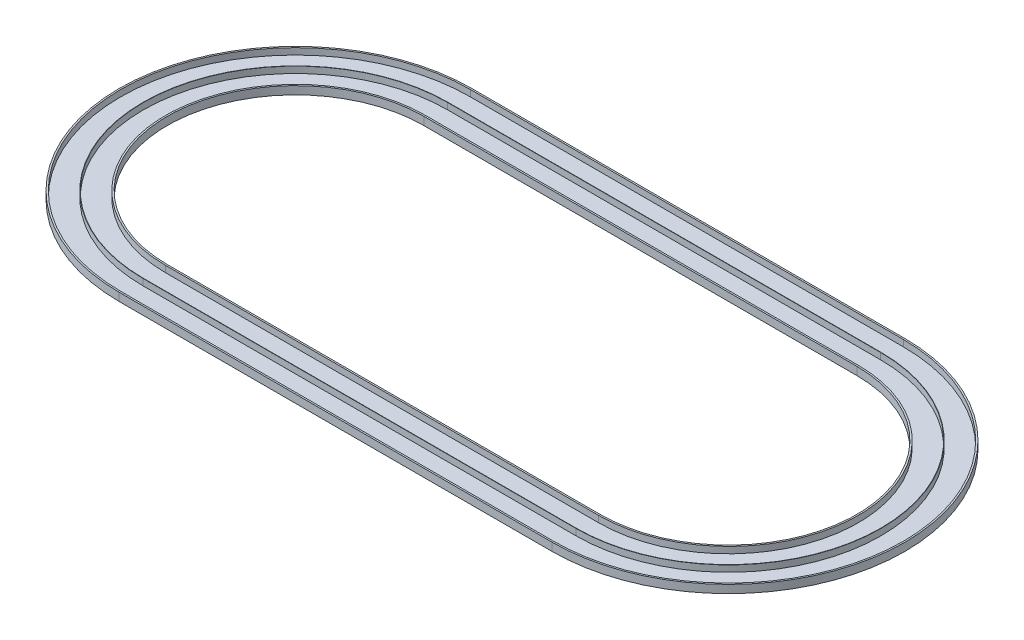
ISO-10303-21;
HEADER;
FILE_DESCRIPTION(('STEP AP214'),'2;1');
FILE_NAME('part.step','',(''),(''),'','','');
FILE_SCHEMA(('AUTOMOTIVE_DESIGN { 1 0 10303 214 1 1 1 1 }'));
ENDSEC;
DATA;
#1=APPLICATION_CONTEXT('core data for automotive mechanical design processes');
#2=APPLICATION_PROTOCOL_DEFINITION('international standard','automotive_design',2000,#1);
#3=PRODUCT_CONTEXT('',#1,'mechanical');
#4=PRODUCT('Part','Part','',(#3));
#5=PRODUCT_RELATED_PRODUCT_CATEGORY('part','',(#4));
#6=PRODUCT_DEFINITION_FORMATION('','',#4);
#7=PRODUCT_DEFINITION_CONTEXT('part definition',#1,'design');
#8=PRODUCT_DEFINITION('design','',#6,#7);
#9=PRODUCT_DEFINITION_SHAPE('','',#8);
#10=(LENGTH_UNIT() NAMED_UNIT(*) SI_UNIT(.MILLI.,.METRE.));
#11=(NAMED_UNIT(*) PLANE_ANGLE_UNIT() SI_UNIT($,.RADIAN.));
#12=(NAMED_UNIT(*) SI_UNIT($,.STERADIAN.) SOLID_ANGLE_UNIT());
#13=UNCERTAINTY_MEASURE_WITH_UNIT(LENGTH_MEASURE(1.E-05),#10,'distance_accuracy_value','');
#14=(GEOMETRIC_REPRESENTATION_CONTEXT(3) GLOBAL_UNCERTAINTY_ASSIGNED_CONTEXT((#13)) GLOBAL_UNIT_ASSIGNED_CONTEXT((#10,
#11,#12)) REPRESENTATION_CONTEXT('',''));
#15=CARTESIAN_POINT('',(0.,0.,0.));
#16=DIRECTION('',(0.,0.,1.));
#17=DIRECTION('',(1.,0.,0.));
#18=AXIS2_PLACEMENT_3D('',#15,#16,#17);
#19=CARTESIAN_POINT('',(0.,2.54,0.));
#20=DIRECTION('',(0.,1.,0.));
#21=DIRECTION('',(0.,0.,1.));
#22=AXIS2_PLACEMENT_3D('',#19,#20,#21);
#23=PLANE('',#22);
#24=CARTESIAN_POINT('',(0.,2.54,0.));
#25=DIRECTION('',(0.,1.,0.));
#26=DIRECTION('',(0.,0.,1.));
#27=AXIS2_PLACEMENT_3D('',#24,#25,#26);
#28=CIRCLE('',#27,276.86);
#29=CARTESIAN_POINT('',(0.,2.54,-276.86));
#30=VERTEX_POINT('',#29);
#31=CARTESIAN_POINT('',(0.,2.54,276.86));
#32=VERTEX_POINT('',#31);
#33=EDGE_CURVE('E262',#30,#32,#28,.T.);
#34=ORIENTED_EDGE('',*,*,#33,.T.);
#35=DIRECTION('',(1.,0.,0.));
#36=VECTOR('',#35,1.);
#37=CARTESIAN_POINT('',(0.,2.54,276.86));
#38=LINE('',#37,#36);
#39=CARTESIAN_POINT('',(685.8,2.54,276.86));
#40=VERTEX_POINT('',#39);
#41=EDGE_CURVE('E265',#32,#40,#38,.T.);
#42=ORIENTED_EDGE('',*,*,#41,.T.);
#43=CARTESIAN_POINT('',(685.8,2.54,0.));
#44=DIRECTION('',(0.,1.,0.));
#45=DIRECTION('',(0.,0.,1.));
#46=AXIS2_PLACEMENT_3D('',#43,#44,#45);
#47=CIRCLE('',#46,276.86);
#48=CARTESIAN_POINT('',(685.8,2.54,-276.86));
#49=VERTEX_POINT('',#48);
#50=EDGE_CURVE('E270',#40,#49,#47,.T.);
#51=ORIENTED_EDGE('',*,*,#50,.T.);
#52=DIRECTION('',(-1.,0.,0.));
#53=VECTOR('',#52,1.);
#54=CARTESIAN_POINT('',(0.,2.54,-276.86));
#55=LINE('',#54,#53);
#56=EDGE_CURVE('E267',#49,#30,#55,.T.);
#57=ORIENTED_EDGE('',*,*,#56,.T.);
#58=EDGE_LOOP('',(#34,#42,#51,#57));
#59=FACE_BOUND('',#58,.T.);
#60=DIRECTION('',(-1.,0.,0.));
#61=VECTOR('',#60,1.);
#62=CARTESIAN_POINT('',(685.8,2.54,-241.554));
#63=LINE('',#62,#61);
#64=CARTESIAN_POINT('',(685.8,2.54,-241.554));
#65=VERTEX_POINT('',#64);
#66=CARTESIAN_POINT('',(0.,2.54,-241.554));
#67=VERTEX_POINT('',#66);
#68=EDGE_CURVE('E248',#65,#67,#63,.T.);
#69=ORIENTED_EDGE('',*,*,#68,.F.);
#70=CARTESIAN_POINT('',(685.8,2.54,0.));
#71=DIRECTION('',(0.,1.,0.));
#72=DIRECTION('',(0.,0.,1.));
#73=AXIS2_PLACEMENT_3D('',#70,#71,#72);
#74=CIRCLE('',#73,241.554);
#75=CARTESIAN_POINT('',(685.8,2.54,241.554));
#76=VERTEX_POINT('',#75);
#77=EDGE_CURVE('E213',#76,#65,#74,.T.);
#78=ORIENTED_EDGE('',*,*,#77,.F.);
#79=DIRECTION('',(1.,0.,0.));
#80=VECTOR('',#79,1.);
#81=CARTESIAN_POINT('',(685.8,2.54,241.554));
#82=LINE('',#81,#80);
#83=CARTESIAN_POINT('',(0.,2.54,241.554));
#84=VERTEX_POINT('',#83);
#85=EDGE_CURVE('E239',#84,#76,#82,.T.);
#86=ORIENTED_EDGE('',*,*,#85,.F.);
#87=CARTESIAN_POINT('',(0.,2.54,0.));
#88=DIRECTION('',(0.,1.,0.));
#89=DIRECTION('',(0.,0.,1.));
#90=AXIS2_PLACEMENT_3D('',#87,#88,#89);
#91=CIRCLE('',#90,241.554);
#92=EDGE_CURVE('E250',#67,#84,#91,.T.);
#93=ORIENTED_EDGE('',*,*,#92,.F.);
#94=EDGE_LOOP('',(#69,#78,#86,#93));
#95=FACE_BOUND('',#94,.T.);
#96=ADVANCED_FACE('F33',(#59,#95),#23,.T.);
#97=CARTESIAN_POINT('',(0.,12.7,0.));
#98=DIRECTION('',(0.,1.,0.));
#99=DIRECTION('',(0.,0.,1.));
#100=AXIS2_PLACEMENT_3D('',#97,#98,#99);
#101=PLANE('',#100);
#102=DIRECTION('',(1.,0.,0.));
#103=VECTOR('',#102,1.);
#104=CARTESIAN_POINT('',(0.,12.7,203.2));
#105=LINE('',#104,#103);
#106=CARTESIAN_POINT('',(0.,12.7,203.2));
#107=VERTEX_POINT('',#106);
#108=CARTESIAN_POINT('',(685.8,12.7,203.2));
#109=VERTEX_POINT('',#108);
#110=EDGE_CURVE('E328',#107,#109,#105,.T.);
#111=ORIENTED_EDGE('',*,*,#110,.F.);
#112=CARTESIAN_POINT('',(0.,12.7,0.));
#113=DIRECTION('',(0.,1.,0.));
#114=DIRECTION('',(0.,0.,1.));
#115=AXIS2_PLACEMENT_3D('',#112,#113,#114);
#116=CIRCLE('',#115,203.2);
#117=CARTESIAN_POINT('',(0.,12.7,-203.2));
#118=VERTEX_POINT('',#117);
#119=EDGE_CURVE('E326',#118,#107,#116,.T.);
#120=ORIENTED_EDGE('',*,*,#119,.F.);
#121=DIRECTION('',(-1.,0.,0.));
#122=VECTOR('',#121,1.);
#123=CARTESIAN_POINT('',(0.,12.7,-203.2));
#124=LINE('',#123,#122);
#125=CARTESIAN_POINT('',(685.8,12.7,-203.2));
#126=VERTEX_POINT('',#125);
#127=EDGE_CURVE('E334',#126,#118,#124,.T.);
#128=ORIENTED_EDGE('',*,*,#127,.F.);
#129=CARTESIAN_POINT('',(685.8,12.7,0.));
#130=DIRECTION('',(0.,1.,0.));
#131=DIRECTION('',(0.,0.,1.));
#132=AXIS2_PLACEMENT_3D('',#129,#130,#131);
#133=CIRCLE('',#132,203.2);
#134=EDGE_CURVE('E331',#109,#126,#133,.T.);
#135=ORIENTED_EDGE('',*,*,#134,.F.);
#136=EDGE_LOOP('',(#111,#120,#128,#135));
#137=FACE_BOUND('',#136,.T.);
#138=CARTESIAN_POINT('',(0.,12.7,0.));
#139=DIRECTION('',(0.,1.,0.));
#140=DIRECTION('',(0.,0.,1.));
#141=AXIS2_PLACEMENT_3D('',#138,#139,#140);
#142=CIRCLE('',#141,205.74);
#143=CARTESIAN_POINT('',(0.,12.7,-205.74));
#144=VERTEX_POINT('',#143);
#145=CARTESIAN_POINT('',(0.,12.7,205.74));
#146=VERTEX_POINT('',#145);
#147=EDGE_CURVE('E284',#144,#146,#142,.T.);
#148=ORIENTED_EDGE('',*,*,#147,.T.);
#149=DIRECTION('',(1.,0.,0.));
#150=VECTOR('',#149,1.);
#151=CARTESIAN_POINT('',(0.,12.7,205.74));
#152=LINE('',#151,#150);
#153=CARTESIAN_POINT('',(685.8,12.7,205.74));
#154=VERTEX_POINT('',#153);
#155=EDGE_CURVE('E318',#146,#154,#152,.T.);
#156=ORIENTED_EDGE('',*,*,#155,.T.);
#157=CARTESIAN_POINT('',(685.8,12.7,0.));
#158=DIRECTION('',(0.,1.,0.));
#159=DIRECTION('',(0.,0.,1.));
#160=AXIS2_PLACEMENT_3D('',#157,#158,#159);
#161=CIRCLE('',#160,205.74);
#162=CARTESIAN_POINT('',(685.8,12.7,-205.74));
#163=VERTEX_POINT('',#162);
#164=EDGE_CURVE('E321',#154,#163,#161,.T.);
#165=ORIENTED_EDGE('',*,*,#164,.T.);
#166=DIRECTION('',(-1.,0.,0.));
#167=VECTOR('',#166,1.);
#168=CARTESIAN_POINT('',(0.,12.7,-205.74));
#169=LINE('',#168,#167);
#170=EDGE_CURVE('E303',#163,#144,#169,.T.);
#171=ORIENTED_EDGE('',*,*,#170,.T.);
#172=EDGE_LOOP('',(#148,#156,#165,#171));
#173=FACE_BOUND('',#172,.T.);
#174=ADVANCED_FACE('F409',(#137,#173),#101,.T.);
#175=CARTESIAN_POINT('',(0.,12.7,0.));
#176=DIRECTION('',(0.,1.,0.));
#177=DIRECTION('',(0.,0.,1.));
#178=AXIS2_PLACEMENT_3D('',#175,#176,#177);
#179=CIRCLE('',#178,276.86);
#180=CARTESIAN_POINT('',(0.,12.7,-276.86));
#181=VERTEX_POINT('',#180);
#182=CARTESIAN_POINT('',(0.,12.7,276.86));
#183=VERTEX_POINT('',#182);
#184=EDGE_CURVE('E269',#181,#183,#179,.T.);
#185=ORIENTED_EDGE('',*,*,#184,.F.);
#186=DIRECTION('',(-1.,0.,0.));
#187=VECTOR('',#186,1.);
#188=CARTESIAN_POINT('',(0.,12.7,-276.86));
#189=LINE('',#188,#187);
#190=CARTESIAN_POINT('',(685.8,12.7,-276.86));
#191=VERTEX_POINT('',#190);
#192=EDGE_CURVE('E294',#191,#181,#189,.T.);
#193=ORIENTED_EDGE('',*,*,#192,.F.);
#194=CARTESIAN_POINT('',(685.8,12.7,0.));
#195=DIRECTION('',(0.,1.,0.));
#196=DIRECTION('',(0.,0.,1.));
#197=AXIS2_PLACEMENT_3D('',#194,#195,#196);
#198=CIRCLE('',#197,276.86);
#199=CARTESIAN_POINT('',(685.8,12.7,276.86));
#200=VERTEX_POINT('',#199);
#201=EDGE_CURVE('E312',#200,#191,#198,.T.);
#202=ORIENTED_EDGE('',*,*,#201,.F.);
#203=DIRECTION('',(1.,0.,0.));
#204=VECTOR('',#203,1.);
#205=CARTESIAN_POINT('',(0.,12.7,276.86));
#206=LINE('',#205,#204);
#207=EDGE_CURVE('E310',#183,#200,#206,.T.);
#208=ORIENTED_EDGE('',*,*,#207,.F.);
#209=EDGE_LOOP('',(#185,#193,#202,#208));
#210=FACE_BOUND('',#209,.T.);
#211=CARTESIAN_POINT('',(0.,12.7,0.));
#212=DIRECTION('',(0.,1.,0.));
#213=DIRECTION('',(0.,0.,1.));
#214=AXIS2_PLACEMENT_3D('',#211,#212,#213);
#215=CIRCLE('',#214,279.4);
#216=CARTESIAN_POINT('',(0.,12.7,-279.4));
#217=VERTEX_POINT('',#216);
#218=CARTESIAN_POINT('',(0.,12.7,279.4));
#219=VERTEX_POINT('',#218);
#220=EDGE_CURVE('E357',#217,#219,#215,.T.);
#221=ORIENTED_EDGE('',*,*,#220,.T.);
#222=DIRECTION('',(1.,0.,0.));
#223=VECTOR('',#222,1.);
#224=CARTESIAN_POINT('',(0.,12.7,279.4));
#225=LINE('',#224,#223);
#226=CARTESIAN_POINT('',(685.8,12.7,279.4));
#227=VERTEX_POINT('',#226);
#228=EDGE_CURVE('E360',#219,#227,#225,.T.);
#229=ORIENTED_EDGE('',*,*,#228,.T.);
#230=CARTESIAN_POINT('',(685.8,12.7,0.));
#231=DIRECTION('',(0.,1.,0.));
#232=DIRECTION('',(0.,0.,1.));
#233=AXIS2_PLACEMENT_3D('',#230,#231,#232);
#234=CIRCLE('',#233,279.4);
#235=CARTESIAN_POINT('',(685.8,12.7,-279.4));
#236=VERTEX_POINT('',#235);
#237=EDGE_CURVE('E363',#227,#236,#234,.T.);
#238=ORIENTED_EDGE('',*,*,#237,.T.);
#239=DIRECTION('',(-1.,0.,0.));
#240=VECTOR('',#239,1.);
#241=CARTESIAN_POINT('',(0.,12.7,-279.4));
#242=LINE('',#241,#240);
#243=EDGE_CURVE('E365',#236,#217,#242,.T.);
#244=ORIENTED_EDGE('',*,*,#243,.T.);
#245=EDGE_LOOP('',(#221,#229,#238,#244));
#246=FACE_BOUND('',#245,.T.);
#247=ADVANCED_FACE('F400',(#210,#246),#101,.T.);
#248=CARTESIAN_POINT('',(0.,0.,0.));
#249=DIRECTION('',(0.,1.,0.));
#250=DIRECTION('',(0.,0.,1.));
#251=AXIS2_PLACEMENT_3D('',#248,#249,#250);
#252=PLANE('',#251);
#253=CARTESIAN_POINT('',(0.,0.,0.));
#254=DIRECTION('',(0.,1.,0.));
#255=DIRECTION('',(0.,0.,1.));
#256=AXIS2_PLACEMENT_3D('',#253,#254,#255);
#257=CIRCLE('',#256,279.4);
#258=CARTESIAN_POINT('',(0.,0.,-279.4));
#259=VERTEX_POINT('',#258);
#260=CARTESIAN_POINT('',(0.,0.,279.4));
#261=VERTEX_POINT('',#260);
#262=EDGE_CURVE('E356',#259,#261,#257,.T.);
#263=ORIENTED_EDGE('',*,*,#262,.F.);
#264=DIRECTION('',(-1.,0.,0.));
#265=VECTOR('',#264,1.);
#266=CARTESIAN_POINT('',(0.,0.,-279.4));
#267=LINE('',#266,#265);
#268=CARTESIAN_POINT('',(685.8,0.,-279.4));
#269=VERTEX_POINT('',#268);
#270=EDGE_CURVE('E361',#269,#259,#267,.T.);
#271=ORIENTED_EDGE('',*,*,#270,.F.);
#272=CARTESIAN_POINT('',(685.8,0.,0.));
#273=DIRECTION('',(0.,1.,0.));
#274=DIRECTION('',(0.,0.,1.));
#275=AXIS2_PLACEMENT_3D('',#272,#273,#274);
#276=CIRCLE('',#275,279.4);
#277=CARTESIAN_POINT('',(685.8,0.,279.4));
#278=VERTEX_POINT('',#277);
#279=EDGE_CURVE('E372',#278,#269,#276,.T.);
#280=ORIENTED_EDGE('',*,*,#279,.F.);
#281=DIRECTION('',(1.,0.,0.));
#282=VECTOR('',#281,1.);
#283=CARTESIAN_POINT('',(0.,0.,279.4));
#284=LINE('',#283,#282);
#285=EDGE_CURVE('E370',#261,#278,#284,.T.);
#286=ORIENTED_EDGE('',*,*,#285,.F.);
#287=EDGE_LOOP('',(#263,#271,#280,#286));
#288=FACE_BOUND('',#287,.T.);
#289=CARTESIAN_POINT('',(0.,0.,0.));
#290=DIRECTION('',(0.,1.,0.));
#291=DIRECTION('',(0.,0.,1.));
#292=AXIS2_PLACEMENT_3D('',#289,#290,#291);
#293=CIRCLE('',#292,203.2);
#294=CARTESIAN_POINT('',(0.,0.,-203.2));
#295=VERTEX_POINT('',#294);
#296=CARTESIAN_POINT('',(0.,0.,203.2));
#297=VERTEX_POINT('',#296);
#298=EDGE_CURVE('E288',#295,#297,#293,.T.);
#299=ORIENTED_EDGE('',*,*,#298,.T.);
#300=DIRECTION('',(1.,0.,0.));
#301=VECTOR('',#300,1.);
#302=CARTESIAN_POINT('',(0.,0.,203.2));
#303=LINE('',#302,#301);
#304=CARTESIAN_POINT('',(685.8,0.,203.2));
#305=VERTEX_POINT('',#304);
#306=EDGE_CURVE('E339',#297,#305,#303,.T.);
#307=ORIENTED_EDGE('',*,*,#306,.T.);
#308=CARTESIAN_POINT('',(685.8,0.,0.));
#309=DIRECTION('',(0.,1.,0.));
#310=DIRECTION('',(0.,0.,1.));
#311=AXIS2_PLACEMENT_3D('',#308,#309,#310);
#312=CIRCLE('',#311,203.2);
#313=CARTESIAN_POINT('',(685.8,0.,-203.2));
#314=VERTEX_POINT('',#313);
#315=EDGE_CURVE('E342',#305,#314,#312,.T.);
#316=ORIENTED_EDGE('',*,*,#315,.T.);
#317=DIRECTION('',(-1.,0.,0.));
#318=VECTOR('',#317,1.);
#319=CARTESIAN_POINT('',(0.,0.,-203.2));
#320=LINE('',#319,#318);
#321=EDGE_CURVE('E329',#314,#295,#320,.T.);
#322=ORIENTED_EDGE('',*,*,#321,.T.);
#323=EDGE_LOOP('',(#299,#307,#316,#322));
#324=FACE_BOUND('',#323,.T.);
#325=ADVANCED_FACE('F390',(#288,#324),#252,.F.);
#326=CARTESIAN_POINT('',(0.,12.7,0.));
#327=DIRECTION('',(0.,-1.,0.));
#328=DIRECTION('',(0.,0.,-1.));
#329=AXIS2_PLACEMENT_3D('',#326,#327,#328);
#330=CYLINDRICAL_SURFACE('',#329,279.4);
#331=ORIENTED_EDGE('',*,*,#262,.T.);
#332=DIRECTION('',(0.,-1.,0.));
#333=VECTOR('',#332,1.);
#334=CARTESIAN_POINT('',(0.,12.7,279.4));
#335=LINE('',#334,#333);
#336=EDGE_CURVE('E11',#219,#261,#335,.T.);
#337=ORIENTED_EDGE('',*,*,#336,.F.);
#338=ORIENTED_EDGE('',*,*,#220,.F.);
#339=DIRECTION('',(0.,-1.,0.));
#340=VECTOR('',#339,1.);
#341=CARTESIAN_POINT('',(0.,12.7,-279.4));
#342=LINE('',#341,#340);
#343=EDGE_CURVE('E367',#217,#259,#342,.T.);
#344=ORIENTED_EDGE('',*,*,#343,.T.);
#345=EDGE_LOOP('',(#331,#337,#338,#344));
#346=FACE_BOUND('',#345,.T.);
#347=ADVANCED_FACE('F35',(#346),#330,.T.);
#348=CARTESIAN_POINT('',(0.,12.7,279.4));
#349=DIRECTION('',(0.,0.,-1.));
#350=DIRECTION('',(-1.,0.,0.));
#351=AXIS2_PLACEMENT_3D('',#348,#349,#350);
#352=PLANE('',#351);
#353=ORIENTED_EDGE('',*,*,#285,.T.);
#354=DIRECTION('',(0.,-1.,0.));
#355=VECTOR('',#354,1.);
#356=CARTESIAN_POINT('',(685.8,12.7,279.4));
#357=LINE('',#356,#355);
#358=EDGE_CURVE('E41',#227,#278,#357,.T.);
#359=ORIENTED_EDGE('',*,*,#358,.F.);
#360=ORIENTED_EDGE('',*,*,#228,.F.);
#361=ORIENTED_EDGE('',*,*,#336,.T.);
#362=EDGE_LOOP('',(#353,#359,#360,#361));
#363=FACE_BOUND('',#362,.T.);
#364=ADVANCED_FACE('F401',(#363),#352,.F.);
#365=CARTESIAN_POINT('',(685.8,12.7,0.));
#366=DIRECTION('',(0.,-1.,0.));
#367=DIRECTION('',(0.,0.,-1.));
#368=AXIS2_PLACEMENT_3D('',#365,#366,#367);
#369=CYLINDRICAL_SURFACE('',#368,279.4);
#370=ORIENTED_EDGE('',*,*,#279,.T.);
#371=DIRECTION('',(0.,-1.,0.));
#372=VECTOR('',#371,1.);
#373=CARTESIAN_POINT('',(685.8,12.7,-279.4));
#374=LINE('',#373,#372);
#375=EDGE_CURVE('E377',#236,#269,#374,.T.);
#376=ORIENTED_EDGE('',*,*,#375,.F.);
#377=ORIENTED_EDGE('',*,*,#237,.F.);
#378=ORIENTED_EDGE('',*,*,#358,.T.);
#379=EDGE_LOOP('',(#370,#376,#377,#378));
#380=FACE_BOUND('',#379,.T.);
#381=ADVANCED_FACE('F384',(#380),#369,.T.);
#382=CARTESIAN_POINT('',(0.,12.7,-279.4));
#383=DIRECTION('',(0.,0.,1.));
#384=DIRECTION('',(1.,0.,0.));
#385=AXIS2_PLACEMENT_3D('',#382,#383,#384);
#386=PLANE('',#385);
#387=ORIENTED_EDGE('',*,*,#270,.T.);
#388=ORIENTED_EDGE('',*,*,#343,.F.);
#389=ORIENTED_EDGE('',*,*,#243,.F.);
#390=ORIENTED_EDGE('',*,*,#375,.T.);
#391=EDGE_LOOP('',(#387,#388,#389,#390));
#392=FACE_BOUND('',#391,.T.);
#393=ADVANCED_FACE('F394',(#392),#386,.F.);
#394=CARTESIAN_POINT('',(0.,12.7,0.));
#395=DIRECTION('',(0.,-1.,0.));
#396=DIRECTION('',(0.,0.,-1.));
#397=AXIS2_PLACEMENT_3D('',#394,#395,#396);
#398=CYLINDRICAL_SURFACE('',#397,203.2);
#399=ORIENTED_EDGE('',*,*,#298,.F.);
#400=DIRECTION('',(0.,-1.,0.));
#401=VECTOR('',#400,1.);
#402=CARTESIAN_POINT('',(0.,12.7,-203.2));
#403=LINE('',#402,#401);
#404=EDGE_CURVE('E336',#118,#295,#403,.T.);
#405=ORIENTED_EDGE('',*,*,#404,.F.);
#406=ORIENTED_EDGE('',*,*,#119,.T.);
#407=DIRECTION('',(0.,-1.,0.));
#408=VECTOR('',#407,1.);
#409=CARTESIAN_POINT('',(0.,12.7,203.2));
#410=LINE('',#409,#408);
#411=EDGE_CURVE('E353',#107,#297,#410,.T.);
#412=ORIENTED_EDGE('',*,*,#411,.T.);
#413=EDGE_LOOP('',(#399,#405,#406,#412));
#414=FACE_BOUND('',#413,.T.);
#415=ADVANCED_FACE('F468',(#414),#398,.F.);
#416=CARTESIAN_POINT('',(0.,12.7,203.2));
#417=DIRECTION('',(0.,0.,-1.));
#418=DIRECTION('',(-1.,0.,0.));
#419=AXIS2_PLACEMENT_3D('',#416,#417,#418);
#420=PLANE('',#419);
#421=ORIENTED_EDGE('',*,*,#306,.F.);
#422=ORIENTED_EDGE('',*,*,#411,.F.);
#423=ORIENTED_EDGE('',*,*,#110,.T.);
#424=DIRECTION('',(0.,-1.,0.));
#425=VECTOR('',#424,1.);
#426=CARTESIAN_POINT('',(685.8,12.7,203.2));
#427=LINE('',#426,#425);
#428=EDGE_CURVE('E351',#109,#305,#427,.T.);
#429=ORIENTED_EDGE('',*,*,#428,.T.);
#430=EDGE_LOOP('',(#421,#422,#423,#429));
#431=FACE_BOUND('',#430,.T.);
#432=ADVANCED_FACE('F464',(#431),#420,.T.);
#433=CARTESIAN_POINT('',(685.8,12.7,0.));
#434=DIRECTION('',(0.,-1.,0.));
#435=DIRECTION('',(0.,0.,-1.));
#436=AXIS2_PLACEMENT_3D('',#433,#434,#435);
#437=CYLINDRICAL_SURFACE('',#436,203.2);
#438=ORIENTED_EDGE('',*,*,#315,.F.);
#439=ORIENTED_EDGE('',*,*,#428,.F.);
#440=ORIENTED_EDGE('',*,*,#134,.T.);
#441=DIRECTION('',(0.,-1.,0.));
#442=VECTOR('',#441,1.);
#443=CARTESIAN_POINT('',(685.8,12.7,-203.2));
#444=LINE('',#443,#442);
#445=EDGE_CURVE('E349',#126,#314,#444,.T.);
#446=ORIENTED_EDGE('',*,*,#445,.T.);
#447=EDGE_LOOP('',(#438,#439,#440,#446));
#448=FACE_BOUND('',#447,.T.);
#449=ADVANCED_FACE('F430',(#448),#437,.F.);
#450=CARTESIAN_POINT('',(0.,12.7,-203.2));
#451=DIRECTION('',(0.,0.,1.));
#452=DIRECTION('',(1.,0.,0.));
#453=AXIS2_PLACEMENT_3D('',#450,#451,#452);
#454=PLANE('',#453);
#455=ORIENTED_EDGE('',*,*,#321,.F.);
#456=ORIENTED_EDGE('',*,*,#445,.F.);
#457=ORIENTED_EDGE('',*,*,#127,.T.);
#458=ORIENTED_EDGE('',*,*,#404,.T.);
#459=EDGE_LOOP('',(#455,#456,#457,#458));
#460=FACE_BOUND('',#459,.T.);
#461=ADVANCED_FACE('F423',(#460),#454,.T.);
#462=CARTESIAN_POINT('',(0.,2.54,0.));
#463=DIRECTION('',(0.,1.,0.));
#464=DIRECTION('',(0.,0.,1.));
#465=AXIS2_PLACEMENT_3D('',#462,#463,#464);
#466=CIRCLE('',#465,241.046);
#467=CARTESIAN_POINT('',(0.,2.54,-241.046));
#468=VERTEX_POINT('',#467);
#469=CARTESIAN_POINT('',(0.,2.54,241.046));
#470=VERTEX_POINT('',#469);
#471=EDGE_CURVE('E56',#468,#470,#466,.T.);
#472=ORIENTED_EDGE('',*,*,#471,.T.);
#473=DIRECTION('',(1.,0.,0.));
#474=VECTOR('',#473,1.);
#475=CARTESIAN_POINT('',(0.,2.54,241.046));
#476=LINE('',#475,#474);
#477=CARTESIAN_POINT('',(685.8,2.54,241.046));
#478=VERTEX_POINT('',#477);
#479=EDGE_CURVE('E212',#470,#478,#476,.T.);
#480=ORIENTED_EDGE('',*,*,#479,.T.);
#481=CARTESIAN_POINT('',(685.8,2.54,0.));
#482=DIRECTION('',(0.,1.,0.));
#483=DIRECTION('',(0.,0.,1.));
#484=AXIS2_PLACEMENT_3D('',#481,#482,#483);
#485=CIRCLE('',#484,241.046);
#486=CARTESIAN_POINT('',(685.8,2.54,-241.046));
#487=VERTEX_POINT('',#486);
#488=EDGE_CURVE('E227',#478,#487,#485,.T.);
#489=ORIENTED_EDGE('',*,*,#488,.T.);
#490=DIRECTION('',(-1.,0.,0.));
#491=VECTOR('',#490,1.);
#492=CARTESIAN_POINT('',(0.,2.54,-241.046));
#493=LINE('',#492,#491);
#494=EDGE_CURVE('E206',#487,#468,#493,.T.);
#495=ORIENTED_EDGE('',*,*,#494,.T.);
#496=EDGE_LOOP('',(#472,#480,#489,#495));
#497=FACE_BOUND('',#496,.T.);
#498=CARTESIAN_POINT('',(0.,2.54,0.));
#499=DIRECTION('',(0.,1.,0.));
#500=DIRECTION('',(0.,0.,1.));
#501=AXIS2_PLACEMENT_3D('',#498,#499,#500);
#502=CIRCLE('',#501,205.74);
#503=CARTESIAN_POINT('',(0.,2.54,-205.74));
#504=VERTEX_POINT('',#503);
#505=CARTESIAN_POINT('',(0.,2.54,205.74));
#506=VERTEX_POINT('',#505);
#507=EDGE_CURVE('E261',#504,#506,#502,.T.);
#508=ORIENTED_EDGE('',*,*,#507,.F.);
#509=DIRECTION('',(-1.,0.,0.));
#510=VECTOR('',#509,1.);
#511=CARTESIAN_POINT('',(0.,2.54,-205.74));
#512=LINE('',#511,#510);
#513=CARTESIAN_POINT('',(685.8,2.54,-205.74));
#514=VERTEX_POINT('',#513);
#515=EDGE_CURVE('E281',#514,#504,#512,.T.);
#516=ORIENTED_EDGE('',*,*,#515,.F.);
#517=CARTESIAN_POINT('',(685.8,2.54,0.));
#518=DIRECTION('',(0.,1.,0.));
#519=DIRECTION('',(0.,0.,1.));
#520=AXIS2_PLACEMENT_3D('',#517,#518,#519);
#521=CIRCLE('',#520,205.74);
#522=CARTESIAN_POINT('',(685.8,2.54,205.74));
#523=VERTEX_POINT('',#522);
#524=EDGE_CURVE('E278',#523,#514,#521,.T.);
#525=ORIENTED_EDGE('',*,*,#524,.F.);
#526=DIRECTION('',(1.,0.,0.));
#527=VECTOR('',#526,1.);
#528=CARTESIAN_POINT('',(0.,2.54,205.74));
#529=LINE('',#528,#527);
#530=EDGE_CURVE('E275',#506,#523,#529,.T.);
#531=ORIENTED_EDGE('',*,*,#530,.F.);
#532=EDGE_LOOP('',(#508,#516,#525,#531));
#533=FACE_BOUND('',#532,.T.);
#534=ADVANCED_FACE('F412',(#497,#533),#23,.T.);
#535=CARTESIAN_POINT('',(0.,12.7,0.));
#536=DIRECTION('',(0.,-1.,0.));
#537=DIRECTION('',(0.,0.,-1.));
#538=AXIS2_PLACEMENT_3D('',#535,#536,#537);
#539=CYLINDRICAL_SURFACE('',#538,276.86);
#540=ORIENTED_EDGE('',*,*,#33,.F.);
#541=DIRECTION('',(0.,-1.,0.));
#542=VECTOR('',#541,1.);
#543=CARTESIAN_POINT('',(0.,12.7,-276.86));
#544=LINE('',#543,#542);
#545=EDGE_CURVE('E290',#181,#30,#544,.T.);
#546=ORIENTED_EDGE('',*,*,#545,.F.);
#547=ORIENTED_EDGE('',*,*,#184,.T.);
#548=DIRECTION('',(0.,1.,0.));
#549=VECTOR('',#548,1.);
#550=CARTESIAN_POINT('',(0.,12.7,276.86));
#551=LINE('',#550,#549);
#552=EDGE_CURVE('E285',#183,#32,#551,.F.);
#553=ORIENTED_EDGE('',*,*,#552,.T.);
#554=EDGE_LOOP('',(#540,#546,#547,#553));
#555=FACE_BOUND('',#554,.T.);
#556=ADVANCED_FACE('F422',(#555),#539,.F.);
#557=CARTESIAN_POINT('',(0.,12.7,276.86));
#558=DIRECTION('',(0.,0.,-1.));
#559=DIRECTION('',(-1.,0.,0.));
#560=AXIS2_PLACEMENT_3D('',#557,#558,#559);
#561=PLANE('',#560);
#562=ORIENTED_EDGE('',*,*,#41,.F.);
#563=ORIENTED_EDGE('',*,*,#552,.F.);
#564=ORIENTED_EDGE('',*,*,#207,.T.);
#565=DIRECTION('',(0.,-1.,0.));
#566=VECTOR('',#565,1.);
#567=CARTESIAN_POINT('',(685.8,12.7,276.86));
#568=LINE('',#567,#566);
#569=EDGE_CURVE('E289',#200,#40,#568,.T.);
#570=ORIENTED_EDGE('',*,*,#569,.T.);
#571=EDGE_LOOP('',(#562,#563,#564,#570));
#572=FACE_BOUND('',#571,.T.);
#573=ADVANCED_FACE('F428',(#572),#561,.T.);
#574=CARTESIAN_POINT('',(685.8,12.7,0.));
#575=DIRECTION('',(0.,-1.,0.));
#576=DIRECTION('',(0.,0.,-1.));
#577=AXIS2_PLACEMENT_3D('',#574,#575,#576);
#578=CYLINDRICAL_SURFACE('',#577,276.86);
#579=ORIENTED_EDGE('',*,*,#50,.F.);
#580=ORIENTED_EDGE('',*,*,#569,.F.);
#581=ORIENTED_EDGE('',*,*,#201,.T.);
#582=DIRECTION('',(0.,1.,0.));
#583=VECTOR('',#582,1.);
#584=CARTESIAN_POINT('',(685.8,12.7,-276.86));
#585=LINE('',#584,#583);
#586=EDGE_CURVE('E293',#191,#49,#585,.F.);
#587=ORIENTED_EDGE('',*,*,#586,.T.);
#588=EDGE_LOOP('',(#579,#580,#581,#587));
#589=FACE_BOUND('',#588,.T.);
#590=ADVANCED_FACE('F527',(#589),#578,.F.);
#591=CARTESIAN_POINT('',(0.,12.7,-276.86));
#592=DIRECTION('',(0.,0.,1.));
#593=DIRECTION('',(1.,0.,0.));
#594=AXIS2_PLACEMENT_3D('',#591,#592,#593);
#595=PLANE('',#594);
#596=ORIENTED_EDGE('',*,*,#56,.F.);
#597=ORIENTED_EDGE('',*,*,#586,.F.);
#598=ORIENTED_EDGE('',*,*,#192,.T.);
#599=ORIENTED_EDGE('',*,*,#545,.T.);
#600=EDGE_LOOP('',(#596,#597,#598,#599));
#601=FACE_BOUND('',#600,.T.);
#602=ADVANCED_FACE('F456',(#601),#595,.T.);
#603=CARTESIAN_POINT('',(0.,12.7,0.));
#604=DIRECTION('',(0.,-1.,0.));
#605=DIRECTION('',(0.,0.,-1.));
#606=AXIS2_PLACEMENT_3D('',#603,#604,#605);
#607=CYLINDRICAL_SURFACE('',#606,205.74);
#608=ORIENTED_EDGE('',*,*,#507,.T.);
#609=DIRECTION('',(0.,-1.,0.));
#610=VECTOR('',#609,1.);
#611=CARTESIAN_POINT('',(0.,12.7,205.74));
#612=LINE('',#611,#610);
#613=EDGE_CURVE('E266',#146,#506,#612,.T.);
#614=ORIENTED_EDGE('',*,*,#613,.F.);
#615=ORIENTED_EDGE('',*,*,#147,.F.);
#616=DIRECTION('',(0.,1.,0.));
#617=VECTOR('',#616,1.);
#618=CARTESIAN_POINT('',(0.,12.7,-205.74));
#619=LINE('',#618,#617);
#620=EDGE_CURVE('E299',#144,#504,#619,.F.);
#621=ORIENTED_EDGE('',*,*,#620,.T.);
#622=EDGE_LOOP('',(#608,#614,#615,#621));
#623=FACE_BOUND('',#622,.T.);
#624=ADVANCED_FACE('F438',(#623),#607,.T.);
#625=CARTESIAN_POINT('',(0.,12.7,205.74));
#626=DIRECTION('',(0.,0.,-1.));
#627=DIRECTION('',(-1.,0.,0.));
#628=AXIS2_PLACEMENT_3D('',#625,#626,#627);
#629=PLANE('',#628);
#630=ORIENTED_EDGE('',*,*,#530,.T.);
#631=DIRECTION('',(0.,1.,0.));
#632=VECTOR('',#631,1.);
#633=CARTESIAN_POINT('',(685.8,12.7,205.74));
#634=LINE('',#633,#632);
#635=EDGE_CURVE('E306',#154,#523,#634,.F.);
#636=ORIENTED_EDGE('',*,*,#635,.F.);
#637=ORIENTED_EDGE('',*,*,#155,.F.);
#638=ORIENTED_EDGE('',*,*,#613,.T.);
#639=EDGE_LOOP('',(#630,#636,#637,#638));
#640=FACE_BOUND('',#639,.T.);
#641=ADVANCED_FACE('F448',(#640),#629,.F.);
#642=CARTESIAN_POINT('',(685.8,12.7,0.));
#643=DIRECTION('',(0.,-1.,0.));
#644=DIRECTION('',(0.,0.,-1.));
#645=AXIS2_PLACEMENT_3D('',#642,#643,#644);
#646=CYLINDRICAL_SURFACE('',#645,205.74);
#647=ORIENTED_EDGE('',*,*,#524,.T.);
#648=DIRECTION('',(0.,-1.,0.));
#649=VECTOR('',#648,1.);
#650=CARTESIAN_POINT('',(685.8,12.7,-205.74));
#651=LINE('',#650,#649);
#652=EDGE_CURVE('E302',#163,#514,#651,.T.);
#653=ORIENTED_EDGE('',*,*,#652,.F.);
#654=ORIENTED_EDGE('',*,*,#164,.F.);
#655=ORIENTED_EDGE('',*,*,#635,.T.);
#656=EDGE_LOOP('',(#647,#653,#654,#655));
#657=FACE_BOUND('',#656,.T.);
#658=ADVANCED_FACE('F444',(#657),#646,.T.);
#659=CARTESIAN_POINT('',(0.,12.7,-205.74));
#660=DIRECTION('',(0.,0.,1.));
#661=DIRECTION('',(1.,0.,0.));
#662=AXIS2_PLACEMENT_3D('',#659,#660,#661);
#663=PLANE('',#662);
#664=ORIENTED_EDGE('',*,*,#515,.T.);
#665=ORIENTED_EDGE('',*,*,#620,.F.);
#666=ORIENTED_EDGE('',*,*,#170,.F.);
#667=ORIENTED_EDGE('',*,*,#652,.T.);
#668=EDGE_LOOP('',(#664,#665,#666,#667));
#669=FACE_BOUND('',#668,.T.);
#670=ADVANCED_FACE('F440',(#669),#663,.F.);
#671=CARTESIAN_POINT('',(685.8,12.7,0.));
#672=DIRECTION('',(0.,1.,0.));
#673=DIRECTION('',(0.,0.,1.));
#674=AXIS2_PLACEMENT_3D('',#671,#672,#673);
#675=PLANE('',#674);
#676=CARTESIAN_POINT('',(685.8,12.7,0.));
#677=DIRECTION('',(0.,1.,0.));
#678=DIRECTION('',(0.,0.,1.));
#679=AXIS2_PLACEMENT_3D('',#676,#677,#678);
#680=CIRCLE('',#679,241.554);
#681=CARTESIAN_POINT('',(685.8,12.7,241.554));
#682=VERTEX_POINT('',#681);
#683=CARTESIAN_POINT('',(685.8,12.7,-241.554));
#684=VERTEX_POINT('',#683);
#685=EDGE_CURVE('E235',#682,#684,#680,.T.);
#686=ORIENTED_EDGE('',*,*,#685,.T.);
#687=DIRECTION('',(-1.,0.,0.));
#688=VECTOR('',#687,1.);
#689=CARTESIAN_POINT('',(685.8,12.7,-241.554));
#690=LINE('',#689,#688);
#691=CARTESIAN_POINT('',(0.,12.7,-241.554));
#692=VERTEX_POINT('',#691);
#693=EDGE_CURVE('E238',#684,#692,#690,.T.);
#694=ORIENTED_EDGE('',*,*,#693,.T.);
#695=CARTESIAN_POINT('',(0.,12.7,0.));
#696=DIRECTION('',(0.,1.,0.));
#697=DIRECTION('',(0.,0.,1.));
#698=AXIS2_PLACEMENT_3D('',#695,#696,#697);
#699=CIRCLE('',#698,241.554);
#700=CARTESIAN_POINT('',(0.,12.7,241.554));
#701=VERTEX_POINT('',#700);
#702=EDGE_CURVE('E241',#692,#701,#699,.T.);
#703=ORIENTED_EDGE('',*,*,#702,.T.);
#704=DIRECTION('',(1.,0.,0.));
#705=VECTOR('',#704,1.);
#706=CARTESIAN_POINT('',(685.8,12.7,241.554));
#707=LINE('',#706,#705);
#708=EDGE_CURVE('E243',#701,#682,#707,.T.);
#709=ORIENTED_EDGE('',*,*,#708,.T.);
#710=EDGE_LOOP('',(#686,#694,#703,#709));
#711=FACE_BOUND('',#710,.T.);
#712=DIRECTION('',(1.,0.,0.));
#713=VECTOR('',#712,1.);
#714=CARTESIAN_POINT('',(0.,12.7,241.046));
#715=LINE('',#714,#713);
#716=CARTESIAN_POINT('',(0.,12.7,241.046));
#717=VERTEX_POINT('',#716);
#718=CARTESIAN_POINT('',(685.8,12.7,241.046));
#719=VERTEX_POINT('',#718);
#720=EDGE_CURVE('E205',#717,#719,#715,.T.);
#721=ORIENTED_EDGE('',*,*,#720,.F.);
#722=CARTESIAN_POINT('',(0.,12.7,0.));
#723=DIRECTION('',(0.,1.,0.));
#724=DIRECTION('',(0.,0.,1.));
#725=AXIS2_PLACEMENT_3D('',#722,#723,#724);
#726=CIRCLE('',#725,241.046);
#727=CARTESIAN_POINT('',(0.,12.7,-241.046));
#728=VERTEX_POINT('',#727);
#729=EDGE_CURVE('E196',#728,#717,#726,.T.);
#730=ORIENTED_EDGE('',*,*,#729,.F.);
#731=DIRECTION('',(-1.,0.,0.));
#732=VECTOR('',#731,1.);
#733=CARTESIAN_POINT('',(0.,12.7,-241.046));
#734=LINE('',#733,#732);
#735=CARTESIAN_POINT('',(685.8,12.7,-241.046));
#736=VERTEX_POINT('',#735);
#737=EDGE_CURVE('E221',#736,#728,#734,.T.);
#738=ORIENTED_EDGE('',*,*,#737,.F.);
#739=CARTESIAN_POINT('',(685.8,12.7,0.));
#740=DIRECTION('',(0.,1.,0.));
#741=DIRECTION('',(0.,0.,1.));
#742=AXIS2_PLACEMENT_3D('',#739,#740,#741);
#743=CIRCLE('',#742,241.046);
#744=EDGE_CURVE('E219',#719,#736,#743,.T.);
#745=ORIENTED_EDGE('',*,*,#744,.F.);
#746=EDGE_LOOP('',(#721,#730,#738,#745));
#747=FACE_BOUND('',#746,.T.);
#748=ADVANCED_FACE('F217',(#711,#747),#675,.T.);
#749=CARTESIAN_POINT('',(685.8,12.7,0.));
#750=DIRECTION('',(0.,-1.,0.));
#751=DIRECTION('',(0.,0.,-1.));
#752=AXIS2_PLACEMENT_3D('',#749,#750,#751);
#753=CYLINDRICAL_SURFACE('',#752,241.554);
#754=ORIENTED_EDGE('',*,*,#77,.T.);
#755=DIRECTION('',(0.,-1.,0.));
#756=VECTOR('',#755,1.);
#757=CARTESIAN_POINT('',(685.8,12.7,-241.554));
#758=LINE('',#757,#756);
#759=EDGE_CURVE('E259',#684,#65,#758,.T.);
#760=ORIENTED_EDGE('',*,*,#759,.F.);
#761=ORIENTED_EDGE('',*,*,#685,.F.);
#762=DIRECTION('',(0.,-1.,0.));
#763=VECTOR('',#762,1.);
#764=CARTESIAN_POINT('',(685.8,12.7,241.554));
#765=LINE('',#764,#763);
#766=EDGE_CURVE('E245',#682,#76,#765,.T.);
#767=ORIENTED_EDGE('',*,*,#766,.T.);
#768=EDGE_LOOP('',(#754,#760,#761,#767));
#769=FACE_BOUND('',#768,.T.);
#770=ADVANCED_FACE('F583',(#769),#753,.T.);
#771=CARTESIAN_POINT('',(685.8,12.7,-241.554));
#772=DIRECTION('',(0.,0.,1.));
#773=DIRECTION('',(1.,0.,0.));
#774=AXIS2_PLACEMENT_3D('',#771,#772,#773);
#775=PLANE('',#774);
#776=ORIENTED_EDGE('',*,*,#68,.T.);
#777=DIRECTION('',(0.,-1.,0.));
#778=VECTOR('',#777,1.);
#779=CARTESIAN_POINT('',(0.,12.7,-241.554));
#780=LINE('',#779,#778);
#781=EDGE_CURVE('E256',#692,#67,#780,.T.);
#782=ORIENTED_EDGE('',*,*,#781,.F.);
#783=ORIENTED_EDGE('',*,*,#693,.F.);
#784=ORIENTED_EDGE('',*,*,#759,.T.);
#785=EDGE_LOOP('',(#776,#782,#783,#784));
#786=FACE_BOUND('',#785,.T.);
#787=ADVANCED_FACE('F593',(#786),#775,.F.);
#788=CARTESIAN_POINT('',(0.,12.7,0.));
#789=DIRECTION('',(0.,-1.,0.));
#790=DIRECTION('',(0.,0.,-1.));
#791=AXIS2_PLACEMENT_3D('',#788,#789,#790);
#792=CYLINDRICAL_SURFACE('',#791,241.554);
#793=ORIENTED_EDGE('',*,*,#92,.T.);
#794=DIRECTION('',(0.,-1.,0.));
#795=VECTOR('',#794,1.);
#796=CARTESIAN_POINT('',(0.,12.7,241.554));
#797=LINE('',#796,#795);
#798=EDGE_CURVE('E48',#701,#84,#797,.T.);
#799=ORIENTED_EDGE('',*,*,#798,.F.);
#800=ORIENTED_EDGE('',*,*,#702,.F.);
#801=ORIENTED_EDGE('',*,*,#781,.T.);
#802=EDGE_LOOP('',(#793,#799,#800,#801));
#803=FACE_BOUND('',#802,.T.);
#804=ADVANCED_FACE('F602',(#803),#792,.T.);
#805=CARTESIAN_POINT('',(685.8,12.7,241.554));
#806=DIRECTION('',(0.,0.,-1.));
#807=DIRECTION('',(-1.,0.,0.));
#808=AXIS2_PLACEMENT_3D('',#805,#806,#807);
#809=PLANE('',#808);
#810=ORIENTED_EDGE('',*,*,#85,.T.);
#811=ORIENTED_EDGE('',*,*,#766,.F.);
#812=ORIENTED_EDGE('',*,*,#708,.F.);
#813=ORIENTED_EDGE('',*,*,#798,.T.);
#814=EDGE_LOOP('',(#810,#811,#812,#813));
#815=FACE_BOUND('',#814,.T.);
#816=ADVANCED_FACE('F612',(#815),#809,.F.);
#817=CARTESIAN_POINT('',(0.,12.7,0.));
#818=DIRECTION('',(0.,-1.,0.));
#819=DIRECTION('',(0.,0.,-1.));
#820=AXIS2_PLACEMENT_3D('',#817,#818,#819);
#821=CYLINDRICAL_SURFACE('',#820,241.046);
#822=ORIENTED_EDGE('',*,*,#471,.F.);
#823=DIRECTION('',(0.,-1.,0.));
#824=VECTOR('',#823,1.);
#825=CARTESIAN_POINT('',(0.,12.7,-241.046));
#826=LINE('',#825,#824);
#827=EDGE_CURVE('E201',#728,#468,#826,.T.);
#828=ORIENTED_EDGE('',*,*,#827,.F.);
#829=ORIENTED_EDGE('',*,*,#729,.T.);
#830=DIRECTION('',(0.,-1.,0.));
#831=VECTOR('',#830,1.);
#832=CARTESIAN_POINT('',(0.,12.7,241.046));
#833=LINE('',#832,#831);
#834=EDGE_CURVE('E199',#717,#470,#833,.T.);
#835=ORIENTED_EDGE('',*,*,#834,.T.);
#836=EDGE_LOOP('',(#822,#828,#829,#835));
#837=FACE_BOUND('',#836,.T.);
#838=ADVANCED_FACE('F198',(#837),#821,.F.);
#839=CARTESIAN_POINT('',(0.,12.7,241.046));
#840=DIRECTION('',(0.,0.,-1.));
#841=DIRECTION('',(-1.,0.,0.));
#842=AXIS2_PLACEMENT_3D('',#839,#840,#841);
#843=PLANE('',#842);
#844=ORIENTED_EDGE('',*,*,#479,.F.);
#845=ORIENTED_EDGE('',*,*,#834,.F.);
#846=ORIENTED_EDGE('',*,*,#720,.T.);
#847=DIRECTION('',(0.,-1.,0.));
#848=VECTOR('',#847,1.);
#849=CARTESIAN_POINT('',(685.8,12.7,241.046));
#850=LINE('',#849,#848);
#851=EDGE_CURVE('E214',#719,#478,#850,.T.);
#852=ORIENTED_EDGE('',*,*,#851,.T.);
#853=EDGE_LOOP('',(#844,#845,#846,#852));
#854=FACE_BOUND('',#853,.T.);
#855=ADVANCED_FACE('F209',(#854),#843,.T.);
#856=CARTESIAN_POINT('',(685.8,12.7,0.));
#857=DIRECTION('',(0.,-1.,0.));
#858=DIRECTION('',(0.,0.,-1.));
#859=AXIS2_PLACEMENT_3D('',#856,#857,#858);
#860=CYLINDRICAL_SURFACE('',#859,241.046);
#861=ORIENTED_EDGE('',*,*,#488,.F.);
#862=ORIENTED_EDGE('',*,*,#851,.F.);
#863=ORIENTED_EDGE('',*,*,#744,.T.);
#864=DIRECTION('',(0.,-1.,0.));
#865=VECTOR('',#864,1.);
#866=CARTESIAN_POINT('',(685.8,12.7,-241.046));
#867=LINE('',#866,#865);
#868=EDGE_CURVE('E231',#736,#487,#867,.T.);
#869=ORIENTED_EDGE('',*,*,#868,.T.);
#870=EDGE_LOOP('',(#861,#862,#863,#869));
#871=FACE_BOUND('',#870,.T.);
#872=ADVANCED_FACE('F638',(#871),#860,.F.);
#873=CARTESIAN_POINT('',(0.,12.7,-241.046));
#874=DIRECTION('',(0.,0.,1.));
#875=DIRECTION('',(1.,0.,0.));
#876=AXIS2_PLACEMENT_3D('',#873,#874,#875);
#877=PLANE('',#876);
#878=ORIENTED_EDGE('',*,*,#494,.F.);
#879=ORIENTED_EDGE('',*,*,#868,.F.);
#880=ORIENTED_EDGE('',*,*,#737,.T.);
#881=ORIENTED_EDGE('',*,*,#827,.T.);
#882=EDGE_LOOP('',(#878,#879,#880,#881));
#883=FACE_BOUND('',#882,.T.);
#884=ADVANCED_FACE('F647',(#883),#877,.T.);
#885=CLOSED_SHELL('',(#96,#174,#247,#325,#347,#364,#381,#393,#415,#432,#449,#461,#534,#556,#573,
#590,#602,#624,#641,#658,#670,#748,#770,#787,#804,#816,#838,#855,#872,#884));
#886=MANIFOLD_SOLID_BREP('B2',#885);
#887=ADVANCED_BREP_SHAPE_REPRESENTATION('',(#18,#886),#14);
#888=SHAPE_DEFINITION_REPRESENTATION(#9,#887);
ENDSEC;
END-ISO-10303-21;
